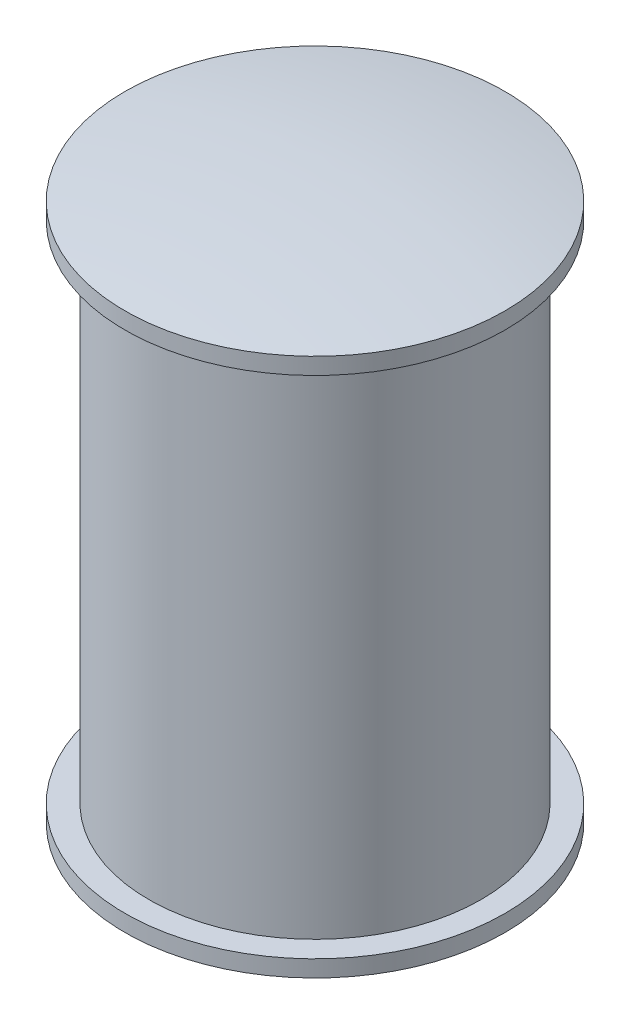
ISO-10303-21;
HEADER;
FILE_DESCRIPTION(('STEP AP214'),'2;1');
FILE_NAME('part.step','',(''),(''),'','','');
FILE_SCHEMA(('AUTOMOTIVE_DESIGN { 1 0 10303 214 1 1 1 1 }'));
ENDSEC;
DATA;
#1=APPLICATION_CONTEXT('core data for automotive mechanical design processes');
#2=APPLICATION_PROTOCOL_DEFINITION('international standard','automotive_design',2000,#1);
#3=PRODUCT_CONTEXT('',#1,'mechanical');
#4=PRODUCT('Part','Part','',(#3));
#5=PRODUCT_RELATED_PRODUCT_CATEGORY('part','',(#4));
#6=PRODUCT_DEFINITION_FORMATION('','',#4);
#7=PRODUCT_DEFINITION_CONTEXT('part definition',#1,'design');
#8=PRODUCT_DEFINITION('design','',#6,#7);
#9=PRODUCT_DEFINITION_SHAPE('','',#8);
#10=(LENGTH_UNIT() NAMED_UNIT(*) SI_UNIT(.MILLI.,.METRE.));
#11=(NAMED_UNIT(*) PLANE_ANGLE_UNIT() SI_UNIT($,.RADIAN.));
#12=(NAMED_UNIT(*) SI_UNIT($,.STERADIAN.) SOLID_ANGLE_UNIT());
#13=UNCERTAINTY_MEASURE_WITH_UNIT(LENGTH_MEASURE(1.E-05),#10,'distance_accuracy_value','');
#14=(GEOMETRIC_REPRESENTATION_CONTEXT(3) GLOBAL_UNCERTAINTY_ASSIGNED_CONTEXT((#13)) GLOBAL_UNIT_ASSIGNED_CONTEXT((#10,
#11,#12)) REPRESENTATION_CONTEXT('',''));
#15=CARTESIAN_POINT('',(0.,0.,0.));
#16=DIRECTION('',(0.,0.,1.));
#17=DIRECTION('',(1.,0.,0.));
#18=AXIS2_PLACEMENT_3D('',#15,#16,#17);
#19=CARTESIAN_POINT('',(0.5,0.76,0.));
#20=DIRECTION('',(0.,-1.,0.));
#21=DIRECTION('',(1.,0.,0.));
#22=AXIS2_PLACEMENT_3D('',#19,#20,#21);
#23=CYLINDRICAL_SURFACE('',#22,1.);
#24=CARTESIAN_POINT('',(0.5,0.76,0.));
#25=DIRECTION('',(0.,-1.,0.));
#26=DIRECTION('',(1.,0.,0.));
#27=AXIS2_PLACEMENT_3D('',#24,#25,#26);
#28=CIRCLE('',#27,1.);
#29=CARTESIAN_POINT('',(1.5,0.76,0.));
#30=VERTEX_POINT('',#29);
#31=EDGE_CURVE('E10',#30,#30,#28,.T.);
#32=ORIENTED_EDGE('',*,*,#31,.T.);
#33=EDGE_LOOP('',(#32));
#34=FACE_BOUND('',#33,.T.);
#35=CARTESIAN_POINT('',(0.499999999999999,-2.28,0.));
#36=DIRECTION('',(0.,-1.,0.));
#37=DIRECTION('',(1.,0.,0.));
#38=AXIS2_PLACEMENT_3D('',#35,#36,#37);
#39=CIRCLE('',#38,1.);
#40=CARTESIAN_POINT('',(1.5,-2.28,0.));
#41=VERTEX_POINT('',#40);
#42=EDGE_CURVE('E53',#41,#41,#39,.T.);
#43=ORIENTED_EDGE('',*,*,#42,.F.);
#44=EDGE_LOOP('',(#43));
#45=FACE_BOUND('',#44,.T.);
#46=ADVANCED_FACE('F38',(#34,#45),#23,.T.);
#47=CARTESIAN_POINT('',(0.5,0.86,0.));
#48=DIRECTION('',(0.,-1.,0.));
#49=DIRECTION('',(1.,0.,0.));
#50=AXIS2_PLACEMENT_3D('',#47,#48,#49);
#51=CYLINDRICAL_SURFACE('',#50,1.14367123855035);
#52=CARTESIAN_POINT('',(0.5,0.86,0.));
#53=DIRECTION('',(0.,1.,0.));
#54=DIRECTION('',(-1.,0.,0.));
#55=AXIS2_PLACEMENT_3D('',#52,#53,#54);
#56=CIRCLE('',#55,1.14367123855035);
#57=CARTESIAN_POINT('',(-0.643671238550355,0.86,0.));
#58=VERTEX_POINT('',#57);
#59=EDGE_CURVE('E42',#58,#58,#56,.T.);
#60=ORIENTED_EDGE('',*,*,#59,.F.);
#61=EDGE_LOOP('',(#60));
#62=FACE_BOUND('',#61,.T.);
#63=CARTESIAN_POINT('',(0.5,0.76,0.));
#64=DIRECTION('',(0.,1.,0.));
#65=DIRECTION('',(-1.,0.,0.));
#66=AXIS2_PLACEMENT_3D('',#63,#64,#65);
#67=CIRCLE('',#66,1.14367123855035);
#68=CARTESIAN_POINT('',(-0.643671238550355,0.76,0.));
#69=VERTEX_POINT('',#68);
#70=EDGE_CURVE('E49',#69,#69,#67,.T.);
#71=ORIENTED_EDGE('',*,*,#70,.T.);
#72=EDGE_LOOP('',(#71));
#73=FACE_BOUND('',#72,.T.);
#74=ADVANCED_FACE('F81',(#62,#73),#51,.T.);
#75=CARTESIAN_POINT('',(0.5,-5.62991950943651,0.));
#76=DIRECTION('',(0.,0.,1.));
#77=DIRECTION('',(1.,0.,0.));
#78=AXIS2_PLACEMENT_3D('',#75,#76,#77);
#79=SPHERICAL_SURFACE('',#78,6.58991950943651);
#80=CARTESIAN_POINT('',(0.5,-5.62991950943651,0.));
#81=DIRECTION('',(0.,1.,0.));
#82=DIRECTION('',(-1.,0.,0.));
#83=AXIS2_PLACEMENT_3D('',#80,#81,#82);
#84=SPHERICAL_SURFACE('',#83,6.58991950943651);
#85=ORIENTED_EDGE('',*,*,#59,.T.);
#86=EDGE_LOOP('',(#85));
#87=FACE_BOUND('',#86,.T.);
#88=ADVANCED_FACE('F40',(#87),#84,.T.);
#89=CARTESIAN_POINT('',(0.5,0.76,0.));
#90=DIRECTION('',(0.,1.,0.));
#91=DIRECTION('',(-1.,0.,0.));
#92=AXIS2_PLACEMENT_3D('',#89,#90,#91);
#93=PLANE('',#92);
#94=ORIENTED_EDGE('',*,*,#31,.F.);
#95=EDGE_LOOP('',(#94));
#96=FACE_BOUND('',#95,.T.);
#97=ORIENTED_EDGE('',*,*,#70,.F.);
#98=EDGE_LOOP('',(#97));
#99=FACE_BOUND('',#98,.T.);
#100=ADVANCED_FACE('F68',(#96,#99),#93,.F.);
#101=CARTESIAN_POINT('',(0.499999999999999,-2.38,0.));
#102=DIRECTION('',(0.,1.,0.));
#103=DIRECTION('',(1.,0.,0.));
#104=AXIS2_PLACEMENT_3D('',#101,#102,#103);
#105=CYLINDRICAL_SURFACE('',#104,1.14367123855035);
#106=CARTESIAN_POINT('',(0.499999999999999,-2.38,0.));
#107=DIRECTION('',(0.,1.,0.));
#108=DIRECTION('',(-1.,0.,0.));
#109=AXIS2_PLACEMENT_3D('',#106,#107,#108);
#110=CIRCLE('',#109,1.14367123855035);
#111=CARTESIAN_POINT('',(-0.643671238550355,-2.38,0.));
#112=VERTEX_POINT('',#111);
#113=EDGE_CURVE('E54',#112,#112,#110,.T.);
#114=ORIENTED_EDGE('',*,*,#113,.T.);
#115=EDGE_LOOP('',(#114));
#116=FACE_BOUND('',#115,.T.);
#117=CARTESIAN_POINT('',(0.499999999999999,-2.28,0.));
#118=DIRECTION('',(0.,1.,0.));
#119=DIRECTION('',(-1.,0.,0.));
#120=AXIS2_PLACEMENT_3D('',#117,#118,#119);
#121=CIRCLE('',#120,1.14367123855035);
#122=CARTESIAN_POINT('',(-0.643671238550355,-2.28,0.));
#123=VERTEX_POINT('',#122);
#124=EDGE_CURVE('E57',#123,#123,#121,.T.);
#125=ORIENTED_EDGE('',*,*,#124,.F.);
#126=EDGE_LOOP('',(#125));
#127=FACE_BOUND('',#126,.T.);
#128=ADVANCED_FACE('F65',(#116,#127),#105,.T.);
#129=CARTESIAN_POINT('',(0.500000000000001,4.10991950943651,0.));
#130=DIRECTION('',(0.,0.,1.));
#131=DIRECTION('',(1.,0.,0.));
#132=AXIS2_PLACEMENT_3D('',#129,#130,#131);
#133=SPHERICAL_SURFACE('',#132,6.58991950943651);
#134=CARTESIAN_POINT('',(0.500000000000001,4.10991950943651,0.));
#135=DIRECTION('',(0.,1.,0.));
#136=DIRECTION('',(-1.,0.,0.));
#137=AXIS2_PLACEMENT_3D('',#134,#135,#136);
#138=SPHERICAL_SURFACE('',#137,6.58991950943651);
#139=ORIENTED_EDGE('',*,*,#113,.F.);
#140=EDGE_LOOP('',(#139));
#141=FACE_BOUND('',#140,.T.);
#142=ADVANCED_FACE('F67',(#141),#138,.T.);
#143=CARTESIAN_POINT('',(0.499999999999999,-2.28,0.));
#144=DIRECTION('',(0.,-1.,0.));
#145=DIRECTION('',(-1.,0.,0.));
#146=AXIS2_PLACEMENT_3D('',#143,#144,#145);
#147=PLANE('',#146);
#148=ORIENTED_EDGE('',*,*,#42,.T.);
#149=EDGE_LOOP('',(#148));
#150=FACE_BOUND('',#149,.T.);
#151=ORIENTED_EDGE('',*,*,#124,.T.);
#152=EDGE_LOOP('',(#151));
#153=FACE_BOUND('',#152,.T.);
#154=ADVANCED_FACE('F63',(#150,#153),#147,.F.);
#155=CLOSED_SHELL('',(#46,#74,#88,#100,#128,#142,#154));
#156=MANIFOLD_SOLID_BREP('B2',#155);
#157=ADVANCED_BREP_SHAPE_REPRESENTATION('',(#18,#156),#14);
#158=SHAPE_DEFINITION_REPRESENTATION(#9,#157);
ENDSEC;
END-ISO-10303-21;
